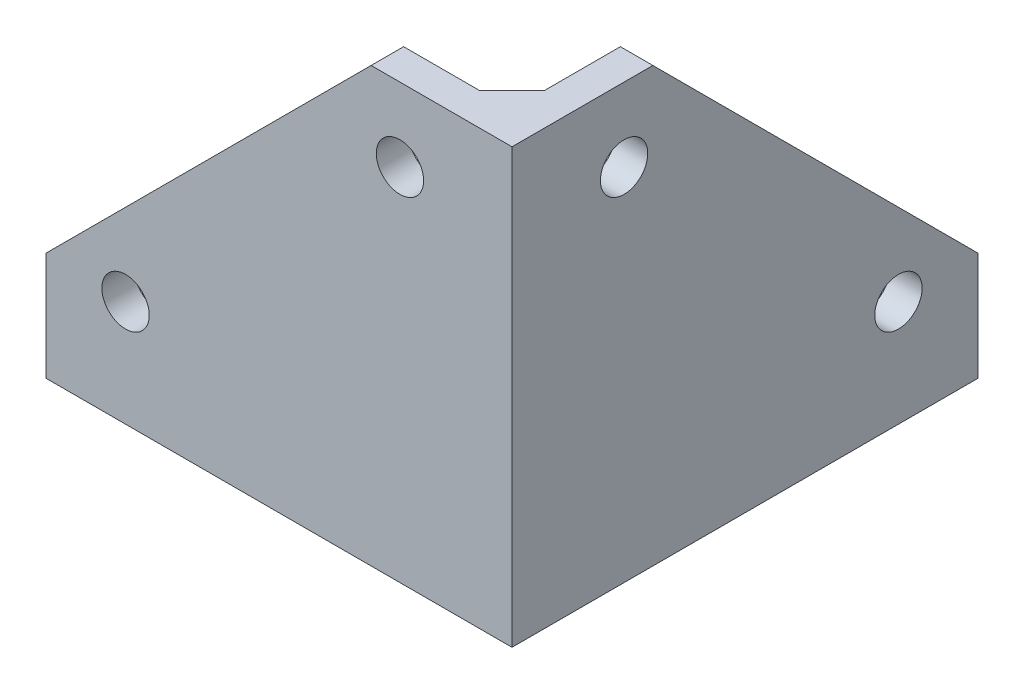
from build123d import *

# Parameters (mm, degrees)
SKETCH1_W           = 40
SKETCH1_H           = 40
SKETCH1_R           = 2.1844
BOSS_EXTRUDE1_DEPTH = 3
EXTRUDE_THIN1_DEPTH = 40
SKETCH3_R           = 2.1844
CUT_EXTRUDE1_DEPTH  = 62.065538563
SKETCH4_R           = 2.1844
CUT_EXTRUDE2_DEPTH  = 62.065538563
CHAMFER1_SIZE       = 30
FILLET1_R           = 30
CHAMFER3_SIZE       = 3


with BuildPart() as part:
    # Sketch1 → Boss-Extrude1 (new body)
    with BuildSketch(Plane(origin=(0, 0, 0), x_dir=(1, 0, 0), z_dir=(0, 1, 0))):
        Rectangle(SKETCH1_W, SKETCH1_H)
        with Locations(Location((14.197784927, 14.197784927, 0), (0, 0, 270))):
            Circle(SKETCH1_R, mode=Mode.SUBTRACT)
        with Locations(Location((-14.197784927, -14.197784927, 0), (0, 0, 270))):
            Circle(SKETCH1_R, mode=Mode.SUBTRACT)
    extrude(amount=BOSS_EXTRUDE1_DEPTH)

    # Sketch2 → Extrude-Thin1 (add)
    with BuildSketch(Plane(origin=(0, 0, 0), x_dir=(1, 0, 0), z_dir=(0, 1, 0))):
        Polygon((-20, -20), (20, -20), (20, 20), (23, 20), (23, -23), (-20, -23), align=None)
    extrude(amount=EXTRUDE_THIN1_DEPTH)

    # Sketch3 → Cut-Extrude1 (cut, through all)
    with BuildSketch(Plane.ZY.offset(-20)):
        with Locations((12.659005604, 33.209580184)):
            Circle(SKETCH3_R)
        with Locations(Location((-12.659005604, 9.790419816, 0), (0, 0, 180))):
            Circle(SKETCH3_R)
    extrude(amount=-CUT_EXTRUDE1_DEPTH, mode=Mode.SUBTRACT)

    # Sketch4 → Cut-Extrude2 (cut, through all)
    with BuildSketch(Plane(origin=(0, 0, 20), x_dir=(-1, 0, 0), z_dir=(0, 0, -1))):
        with Locations((-12.659005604, 33.209580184)):
            Circle(SKETCH4_R)
        with Locations((12.659005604, 9.790419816)):
            Circle(SKETCH4_R)
    extrude(amount=-CUT_EXTRUDE2_DEPTH, mode=Mode.SUBTRACT)

    # Chamfer1
    chamfer1_edges = [part.edges().sort_by_distance(p)[0] for p in [
        (21.5, 40, -20),
        (-20, 40, 21.5),
    ]]
    chamfer(chamfer1_edges, length=CHAMFER1_SIZE)

    # Fillet1
    fillet1_edges = [part.edges().sort_by_distance(p)[0] for p in [
        (-20, 1.5, -20),
    ]]
    fillet(fillet1_edges, radius=FILLET1_R)

    # Chamfer3
    chamfer3_edges = [part.edges().sort_by_distance(p)[0] for p in [
        (20, 21.5, 20),
        (0, 3, 20),
        (20, 3, 0),
    ]]
    chamfer(chamfer3_edges, length=CHAMFER3_SIZE)


solid = part.part
